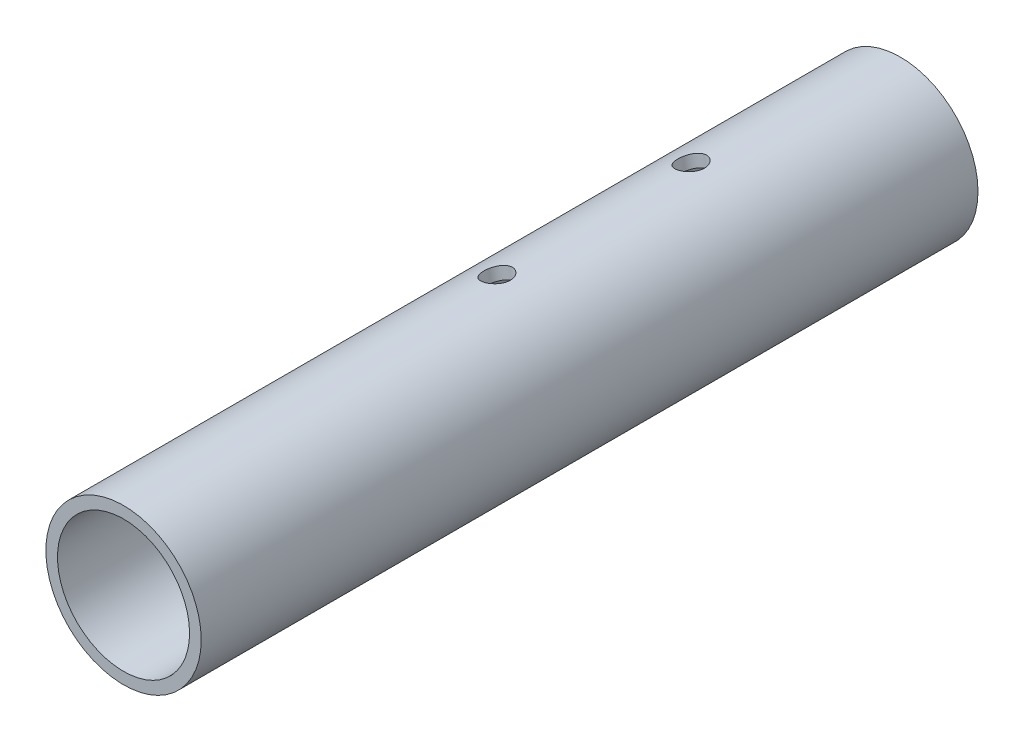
from build123d import *

# Parameters (mm, degrees)
ESQUISSE1_R             = 20
ESQUISSE1_R_2           = 17
BOSS_EXTRU_1_DEPTH      = 200
ESQUISSE2_R             = 3.5
ENL_V_MAT_EXTRU_1_DEPTH = 207.35460695


with BuildPart() as part:
    # Esquisse1 → Boss.-Extru.1 (new body)
    with BuildSketch(Plane.XY):
        with Locations((-10.424186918, -1.53847981)):
            Circle(ESQUISSE1_R)
        with Locations((-10.424186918, -1.53847981)):
            Circle(ESQUISSE1_R_2, mode=Mode.SUBTRACT)
    extrude(amount=BOSS_EXTRU_1_DEPTH)

    # Esquisse2 → Enl_v. mat.-Extru.1 (cut, through all)
    with BuildSketch(Plane(origin=(3.802807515, -19.098254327, 0), x_dir=(0.9807466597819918, 0.19528438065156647, 0), z_dir=(0.19528438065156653, -0.9807466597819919, 0))):
        with Locations((-10.523927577, 100)):
            Circle(ESQUISSE2_R)
        with Locations((-10.523927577, 50)):
            Circle(ESQUISSE2_R)
    extrude(amount=-ENL_V_MAT_EXTRU_1_DEPTH, mode=Mode.SUBTRACT)


solid = part.part
